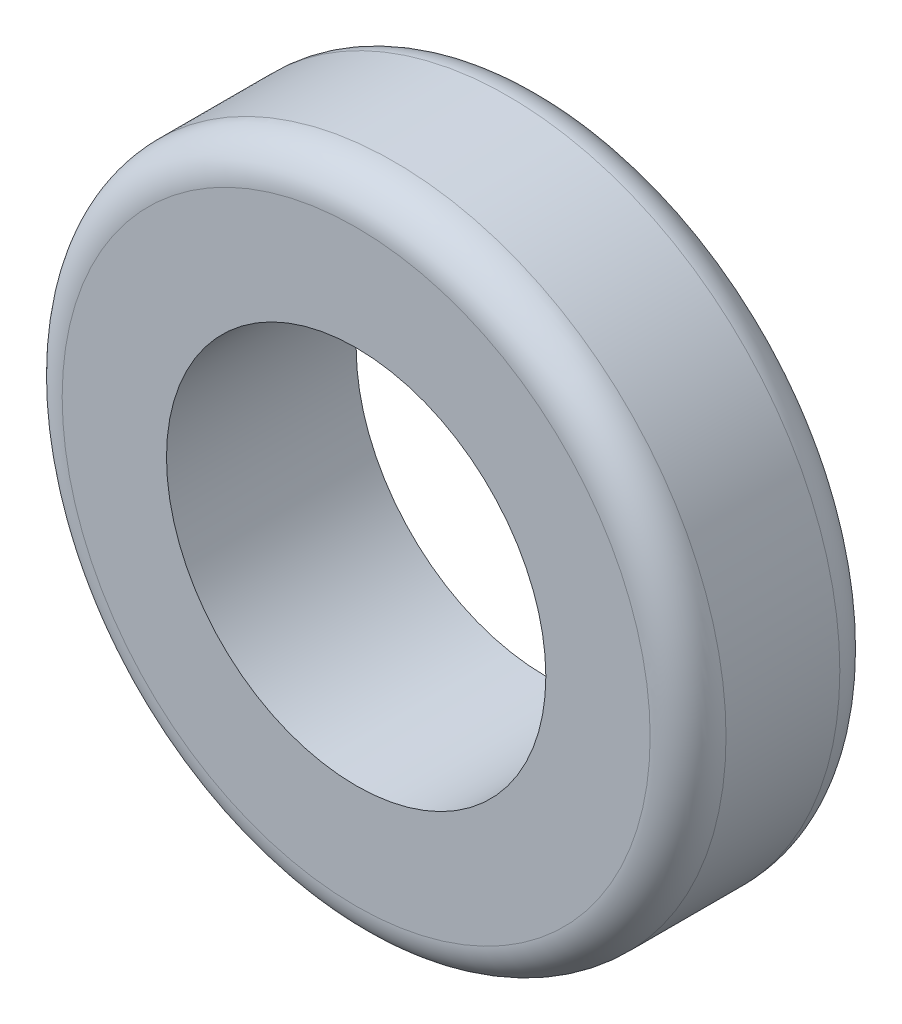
ISO-10303-21;
HEADER;
FILE_DESCRIPTION(('STEP AP214'),'2;1');
FILE_NAME('part.step','',(''),(''),'','','');
FILE_SCHEMA(('AUTOMOTIVE_DESIGN { 1 0 10303 214 1 1 1 1 }'));
ENDSEC;
DATA;
#1=APPLICATION_CONTEXT('core data for automotive mechanical design processes');
#2=APPLICATION_PROTOCOL_DEFINITION('international standard','automotive_design',2000,#1);
#3=PRODUCT_CONTEXT('',#1,'mechanical');
#4=PRODUCT('Part','Part','',(#3));
#5=PRODUCT_RELATED_PRODUCT_CATEGORY('part','',(#4));
#6=PRODUCT_DEFINITION_FORMATION('','',#4);
#7=PRODUCT_DEFINITION_CONTEXT('part definition',#1,'design');
#8=PRODUCT_DEFINITION('design','',#6,#7);
#9=PRODUCT_DEFINITION_SHAPE('','',#8);
#10=(LENGTH_UNIT() NAMED_UNIT(*) SI_UNIT(.MILLI.,.METRE.));
#11=(NAMED_UNIT(*) PLANE_ANGLE_UNIT() SI_UNIT($,.RADIAN.));
#12=(NAMED_UNIT(*) SI_UNIT($,.STERADIAN.) SOLID_ANGLE_UNIT());
#13=UNCERTAINTY_MEASURE_WITH_UNIT(LENGTH_MEASURE(1.E-05),#10,'distance_accuracy_value','');
#14=(GEOMETRIC_REPRESENTATION_CONTEXT(3) GLOBAL_UNCERTAINTY_ASSIGNED_CONTEXT((#13)) GLOBAL_UNIT_ASSIGNED_CONTEXT((#10,
#11,#12)) REPRESENTATION_CONTEXT('',''));
#15=CARTESIAN_POINT('',(0.,0.,0.));
#16=DIRECTION('',(0.,0.,1.));
#17=DIRECTION('',(1.,0.,0.));
#18=AXIS2_PLACEMENT_3D('',#15,#16,#17);
#19=CARTESIAN_POINT('',(0.,0.,1.));
#20=DIRECTION('',(0.,0.,-1.));
#21=DIRECTION('',(-1.,0.,0.));
#22=AXIS2_PLACEMENT_3D('',#19,#20,#21);
#23=CYLINDRICAL_SURFACE('',#22,1.75);
#24=CARTESIAN_POINT('',(0.,0.,0.8));
#25=DIRECTION('',(0.,0.,1.));
#26=DIRECTION('',(1.,0.,0.));
#27=AXIS2_PLACEMENT_3D('',#24,#25,#26);
#28=CIRCLE('',#27,1.75);
#29=CARTESIAN_POINT('',(1.75,0.,0.8));
#30=VERTEX_POINT('',#29);
#31=EDGE_CURVE('E31',#30,#30,#28,.F.);
#32=ORIENTED_EDGE('',*,*,#31,.T.);
#33=EDGE_LOOP('',(#32));
#34=FACE_BOUND('',#33,.T.);
#35=CARTESIAN_POINT('',(0.,0.,0.2));
#36=DIRECTION('',(0.,0.,1.));
#37=DIRECTION('',(1.,0.,0.));
#38=AXIS2_PLACEMENT_3D('',#35,#36,#37);
#39=CIRCLE('',#38,1.75);
#40=CARTESIAN_POINT('',(1.75,0.,0.2));
#41=VERTEX_POINT('',#40);
#42=EDGE_CURVE('E35',#41,#41,#39,.T.);
#43=ORIENTED_EDGE('',*,*,#42,.T.);
#44=EDGE_LOOP('',(#43));
#45=FACE_BOUND('',#44,.T.);
#46=ADVANCED_FACE('F25',(#34,#45),#23,.T.);
#47=CARTESIAN_POINT('',(0.,0.,1.));
#48=DIRECTION('',(0.,0.,1.));
#49=DIRECTION('',(1.,0.,0.));
#50=AXIS2_PLACEMENT_3D('',#47,#48,#49);
#51=PLANE('',#50);
#52=CARTESIAN_POINT('',(0.,0.,1.));
#53=DIRECTION('',(0.,0.,1.));
#54=DIRECTION('',(1.,0.,0.));
#55=AXIS2_PLACEMENT_3D('',#52,#53,#54);
#56=CIRCLE('',#55,1.55);
#57=CARTESIAN_POINT('',(1.55,0.,1.));
#58=VERTEX_POINT('',#57);
#59=EDGE_CURVE('E39',#58,#58,#56,.T.);
#60=ORIENTED_EDGE('',*,*,#59,.T.);
#61=EDGE_LOOP('',(#60));
#62=FACE_BOUND('',#61,.T.);
#63=CARTESIAN_POINT('',(0.,0.,1.));
#64=DIRECTION('',(0.,0.,1.));
#65=DIRECTION('',(1.,0.,0.));
#66=AXIS2_PLACEMENT_3D('',#63,#64,#65);
#67=CIRCLE('',#66,1.);
#68=CARTESIAN_POINT('',(1.,0.,1.));
#69=VERTEX_POINT('',#68);
#70=EDGE_CURVE('E47',#69,#69,#67,.T.);
#71=ORIENTED_EDGE('',*,*,#70,.F.);
#72=EDGE_LOOP('',(#71));
#73=FACE_BOUND('',#72,.T.);
#74=ADVANCED_FACE('F53',(#62,#73),#51,.T.);
#75=CARTESIAN_POINT('',(0.,0.,0.));
#76=DIRECTION('',(0.,0.,1.));
#77=DIRECTION('',(1.,0.,0.));
#78=AXIS2_PLACEMENT_3D('',#75,#76,#77);
#79=PLANE('',#78);
#80=CARTESIAN_POINT('',(0.,0.,0.));
#81=DIRECTION('',(0.,0.,1.));
#82=DIRECTION('',(1.,0.,0.));
#83=AXIS2_PLACEMENT_3D('',#80,#81,#82);
#84=CIRCLE('',#83,1.55);
#85=CARTESIAN_POINT('',(1.55,0.,0.));
#86=VERTEX_POINT('',#85);
#87=EDGE_CURVE('E10',#86,#86,#84,.F.);
#88=ORIENTED_EDGE('',*,*,#87,.T.);
#89=EDGE_LOOP('',(#88));
#90=FACE_BOUND('',#89,.T.);
#91=CARTESIAN_POINT('',(0.,0.,0.));
#92=DIRECTION('',(0.,0.,1.));
#93=DIRECTION('',(1.,0.,0.));
#94=AXIS2_PLACEMENT_3D('',#91,#92,#93);
#95=CIRCLE('',#94,1.);
#96=CARTESIAN_POINT('',(1.,0.,0.));
#97=VERTEX_POINT('',#96);
#98=EDGE_CURVE('E44',#97,#97,#95,.T.);
#99=ORIENTED_EDGE('',*,*,#98,.T.);
#100=EDGE_LOOP('',(#99));
#101=FACE_BOUND('',#100,.T.);
#102=ADVANCED_FACE('F55',(#90,#101),#79,.F.);
#103=CARTESIAN_POINT('',(0.,0.,0.));
#104=DIRECTION('',(0.,0.,1.));
#105=DIRECTION('',(1.,0.,0.));
#106=AXIS2_PLACEMENT_3D('',#103,#104,#105);
#107=CYLINDRICAL_SURFACE('',#106,1.);
#108=ORIENTED_EDGE('',*,*,#98,.F.);
#109=EDGE_LOOP('',(#108));
#110=FACE_BOUND('',#109,.T.);
#111=ORIENTED_EDGE('',*,*,#70,.T.);
#112=EDGE_LOOP('',(#111));
#113=FACE_BOUND('',#112,.T.);
#114=ADVANCED_FACE('F51',(#110,#113),#107,.F.);
#115=CARTESIAN_POINT('',(0.,0.,0.8));
#116=DIRECTION('',(0.,0.,1.));
#117=DIRECTION('',(1.,0.,0.));
#118=AXIS2_PLACEMENT_3D('',#115,#116,#117);
#119=TOROIDAL_SURFACE('',#118,1.55,0.2);
#120=ORIENTED_EDGE('',*,*,#31,.F.);
#121=EDGE_LOOP('',(#120));
#122=FACE_BOUND('',#121,.T.);
#123=ORIENTED_EDGE('',*,*,#59,.F.);
#124=EDGE_LOOP('',(#123));
#125=FACE_BOUND('',#124,.T.);
#126=ADVANCED_FACE('F65',(#122,#125),#119,.T.);
#127=CARTESIAN_POINT('',(0.,0.,0.2));
#128=DIRECTION('',(0.,0.,1.));
#129=DIRECTION('',(1.,0.,0.));
#130=AXIS2_PLACEMENT_3D('',#127,#128,#129);
#131=TOROIDAL_SURFACE('',#130,1.55,0.2);
#132=ORIENTED_EDGE('',*,*,#87,.F.);
#133=EDGE_LOOP('',(#132));
#134=FACE_BOUND('',#133,.T.);
#135=ORIENTED_EDGE('',*,*,#42,.F.);
#136=EDGE_LOOP('',(#135));
#137=FACE_BOUND('',#136,.T.);
#138=ADVANCED_FACE('F69',(#134,#137),#131,.T.);
#139=CLOSED_SHELL('',(#46,#74,#102,#114,#126,#138));
#140=MANIFOLD_SOLID_BREP('B2',#139);
#141=ADVANCED_BREP_SHAPE_REPRESENTATION('',(#18,#140),#14);
#142=SHAPE_DEFINITION_REPRESENTATION(#9,#141);
ENDSEC;
END-ISO-10303-21;
